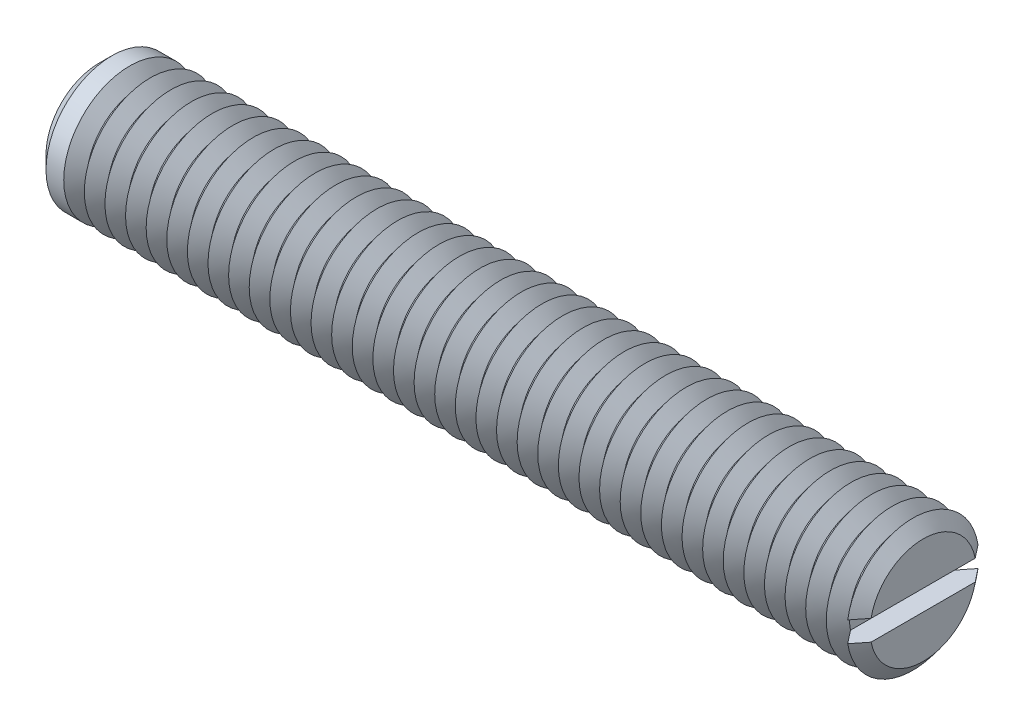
from build123d import *

# Parameters (mm, degrees)
SKETCH1_R       = 4
EXTRUDE1_DEPTH  = 25
SKETCH2_W       = 1.25
SKETCH2_H       = 1.25
EXTRUDE2_DEPTH  = 6
CHAMFER1_SIZE   = 0.8
LPATTERN1_COUNT = 39
LPATTERN1_PITCH = 1.25


with BuildPart() as part:
    # Sketch1 → Extrude1 (new, symmetric)
    with BuildSketch(Plane(origin=(0, 0, 0), x_dir=(0, 0, -1), z_dir=(1, 0, 0))):
        Circle(SKETCH1_R)
    extrude(amount=EXTRUDE1_DEPTH, both=True)

    # Sketch2 → Extrude2 (cut, symmetric)
    with BuildSketch(Plane.XY):
        with Locations((24.375, 0)):
            Rectangle(SKETCH2_W, SKETCH2_H)
    extrude(amount=EXTRUDE2_DEPTH, both=True, mode=Mode.SUBTRACT)

    # Chamfer1
    chamfer1_edges = [part.edges().sort_by_distance(p)[0] for p in [
        (-25, 0, 4),
    ]]
    chamfer(chamfer1_edges, length=CHAMFER1_SIZE)

    # Sketch3 → Cut-Revolve1 (revolve, cut)
    with BuildSketch(Plane.XY, mode=Mode.PRIVATE) as cut_revolve1_sk:
        Polygon((24.375, -4), (25.625, -4), (25, -3.21937525), align=None)
    cut_revolve1 = revolve(cut_revolve1_sk.sketch.rotate(Axis((0, 0, 0), (1, 0, 0)), 278.989299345), axis=Axis((0, 0, 0), (1, 0, 0)), mode=Mode.SUBTRACT)

    # LPattern1: Cut-Revolve1 ×39
    with Locations(*[(-i * LPATTERN1_PITCH, 0, 0) for i in range(1, LPATTERN1_COUNT)]):
        add(cut_revolve1, mode=Mode.SUBTRACT)


solid = part.part
